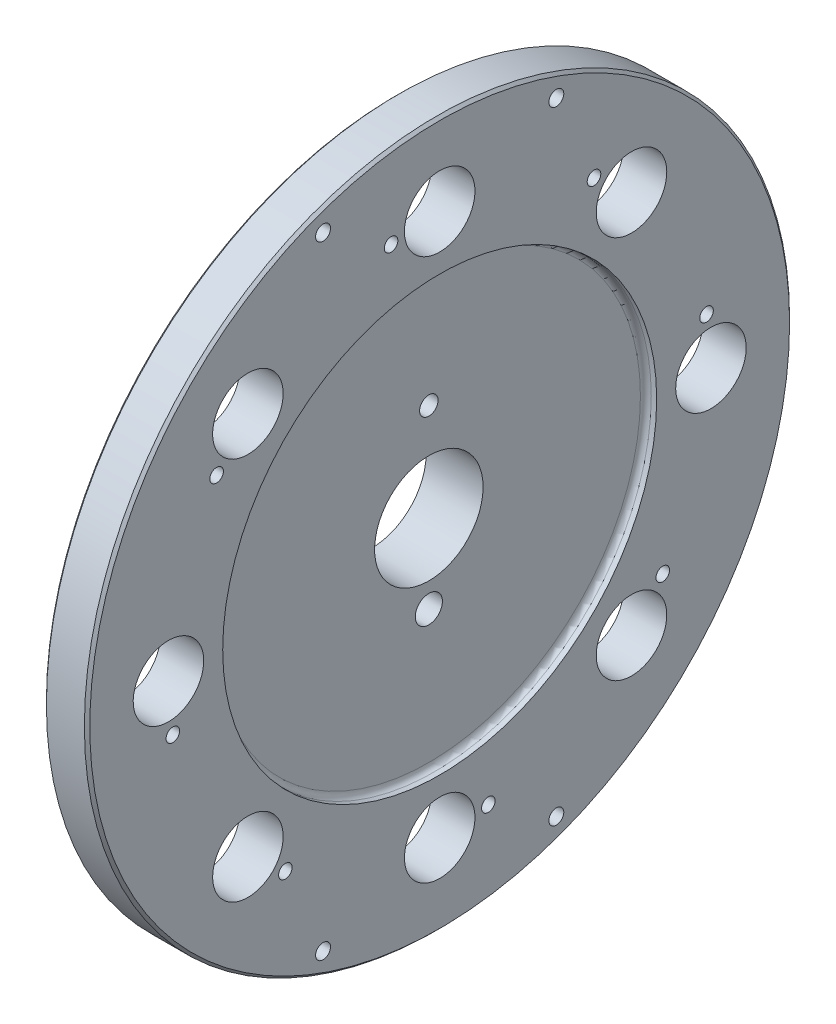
ISO-10303-21;
HEADER;
FILE_DESCRIPTION(('STEP AP214'),'2;1');
FILE_NAME('part.step','',(''),(''),'','','');
FILE_SCHEMA(('AUTOMOTIVE_DESIGN { 1 0 10303 214 1 1 1 1 }'));
ENDSEC;
DATA;
#1=APPLICATION_CONTEXT('core data for automotive mechanical design processes');
#2=APPLICATION_PROTOCOL_DEFINITION('international standard','automotive_design',2000,#1);
#3=PRODUCT_CONTEXT('',#1,'mechanical');
#4=PRODUCT('Part','Part','',(#3));
#5=PRODUCT_RELATED_PRODUCT_CATEGORY('part','',(#4));
#6=PRODUCT_DEFINITION_FORMATION('','',#4);
#7=PRODUCT_DEFINITION_CONTEXT('part definition',#1,'design');
#8=PRODUCT_DEFINITION('design','',#6,#7);
#9=PRODUCT_DEFINITION_SHAPE('','',#8);
#10=(LENGTH_UNIT() NAMED_UNIT(*) SI_UNIT(.MILLI.,.METRE.));
#11=(NAMED_UNIT(*) PLANE_ANGLE_UNIT() SI_UNIT($,.RADIAN.));
#12=(NAMED_UNIT(*) SI_UNIT($,.STERADIAN.) SOLID_ANGLE_UNIT());
#13=UNCERTAINTY_MEASURE_WITH_UNIT(LENGTH_MEASURE(1.E-05),#10,'distance_accuracy_value','');
#14=(GEOMETRIC_REPRESENTATION_CONTEXT(3) GLOBAL_UNCERTAINTY_ASSIGNED_CONTEXT((#13)) GLOBAL_UNIT_ASSIGNED_CONTEXT((#10,
#11,#12)) REPRESENTATION_CONTEXT('',''));
#15=CARTESIAN_POINT('',(0.,0.,0.));
#16=DIRECTION('',(0.,0.,1.));
#17=DIRECTION('',(1.,0.,0.));
#18=AXIS2_PLACEMENT_3D('',#15,#16,#17);
#19=CARTESIAN_POINT('',(14.9768902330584,80.,0.));
#20=DIRECTION('',(1.,0.,0.));
#21=DIRECTION('',(0.,0.,-1.));
#22=AXIS2_PLACEMENT_3D('',#19,#20,#21);
#23=PLANE('',#22);
#24=CARTESIAN_POINT('',(14.9768902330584,114.705056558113,-43.));
#25=DIRECTION('',(-1.,0.,0.));
#26=DIRECTION('',(0.,0.,1.));
#27=AXIS2_PLACEMENT_3D('',#24,#25,#26);
#28=CIRCLE('',#27,2.75);
#29=CARTESIAN_POINT('',(14.9768902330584,114.705056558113,-40.25));
#30=VERTEX_POINT('',#29);
#31=EDGE_CURVE('E412',#30,#30,#28,.T.);
#32=ORIENTED_EDGE('',*,*,#31,.T.);
#33=EDGE_LOOP('',(#32));
#34=FACE_BOUND('',#33,.T.);
#35=CARTESIAN_POINT('',(14.9768902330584,114.705056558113,43.));
#36=DIRECTION('',(-1.,0.,0.));
#37=DIRECTION('',(0.,0.,1.));
#38=AXIS2_PLACEMENT_3D('',#35,#36,#37);
#39=CIRCLE('',#38,2.75);
#40=CARTESIAN_POINT('',(14.9768902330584,114.705056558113,45.75));
#41=VERTEX_POINT('',#40);
#42=EDGE_CURVE('E423',#41,#41,#39,.T.);
#43=ORIENTED_EDGE('',*,*,#42,.T.);
#44=EDGE_LOOP('',(#43));
#45=FACE_BOUND('',#44,.T.);
#46=CARTESIAN_POINT('',(14.9768902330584,-114.705056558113,-43.));
#47=DIRECTION('',(-1.,0.,0.));
#48=DIRECTION('',(0.,0.,1.));
#49=AXIS2_PLACEMENT_3D('',#46,#47,#48);
#50=CIRCLE('',#49,2.75);
#51=CARTESIAN_POINT('',(14.9768902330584,-114.705056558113,-40.25));
#52=VERTEX_POINT('',#51);
#53=EDGE_CURVE('E435',#52,#52,#50,.T.);
#54=ORIENTED_EDGE('',*,*,#53,.T.);
#55=EDGE_LOOP('',(#54));
#56=FACE_BOUND('',#55,.T.);
#57=CARTESIAN_POINT('',(14.9768902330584,-114.705056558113,43.));
#58=DIRECTION('',(-1.,0.,0.));
#59=DIRECTION('',(0.,0.,1.));
#60=AXIS2_PLACEMENT_3D('',#57,#58,#59);
#61=CIRCLE('',#60,2.75);
#62=CARTESIAN_POINT('',(14.9768902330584,-114.705056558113,45.75));
#63=VERTEX_POINT('',#62);
#64=EDGE_CURVE('E446',#63,#63,#61,.T.);
#65=ORIENTED_EDGE('',*,*,#64,.T.);
#66=EDGE_LOOP('',(#65));
#67=FACE_BOUND('',#66,.T.);
#68=CARTESIAN_POINT('',(14.9768902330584,-82.2414343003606,56.8888959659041));
#69=DIRECTION('',(1.,0.,0.));
#70=DIRECTION('',(0.,0.,-1.));
#71=AXIS2_PLACEMENT_3D('',#68,#69,#70);
#72=CIRCLE('',#71,2.49999999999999);
#73=CARTESIAN_POINT('',(14.9768902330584,-82.2414343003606,54.3888959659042));
#74=VERTEX_POINT('',#73);
#75=EDGE_CURVE('E119',#74,#74,#72,.T.);
#76=ORIENTED_EDGE('',*,*,#75,.F.);
#77=EDGE_LOOP('',(#76));
#78=FACE_BOUND('',#77,.T.);
#79=CARTESIAN_POINT('',(14.9768902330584,-17.9269517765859,98.3799999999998));
#80=DIRECTION('',(1.,0.,0.));
#81=DIRECTION('',(0.,0.,-1.));
#82=AXIS2_PLACEMENT_3D('',#79,#80,#81);
#83=CIRCLE('',#82,2.49999999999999);
#84=CARTESIAN_POINT('',(14.9768902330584,-17.9269517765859,95.8799999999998));
#85=VERTEX_POINT('',#84);
#86=EDGE_CURVE('E109',#85,#85,#83,.T.);
#87=ORIENTED_EDGE('',*,*,#86,.F.);
#88=EDGE_LOOP('',(#87));
#89=FACE_BOUND('',#88,.T.);
#90=CARTESIAN_POINT('',(14.9768902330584,56.8888959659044,82.2414343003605));
#91=DIRECTION('',(1.,0.,0.));
#92=DIRECTION('',(0.,0.,-1.));
#93=AXIS2_PLACEMENT_3D('',#90,#91,#92);
#94=CIRCLE('',#93,2.49999999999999);
#95=CARTESIAN_POINT('',(14.9768902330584,56.8888959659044,79.7414343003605));
#96=VERTEX_POINT('',#95);
#97=EDGE_CURVE('E106',#96,#96,#94,.T.);
#98=ORIENTED_EDGE('',*,*,#97,.F.);
#99=EDGE_LOOP('',(#98));
#100=FACE_BOUND('',#99,.T.);
#101=CARTESIAN_POINT('',(14.9768902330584,98.38,17.9269517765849));
#102=DIRECTION('',(1.,0.,0.));
#103=DIRECTION('',(0.,0.,-1.));
#104=AXIS2_PLACEMENT_3D('',#101,#102,#103);
#105=CIRCLE('',#104,2.49999999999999);
#106=CARTESIAN_POINT('',(14.9768902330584,98.38,15.4269517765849));
#107=VERTEX_POINT('',#106);
#108=EDGE_CURVE('E103',#107,#107,#105,.T.);
#109=ORIENTED_EDGE('',*,*,#108,.F.);
#110=EDGE_LOOP('',(#109));
#111=FACE_BOUND('',#110,.T.);
#112=CARTESIAN_POINT('',(14.9768902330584,82.2414343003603,-56.8888959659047));
#113=DIRECTION('',(1.,0.,0.));
#114=DIRECTION('',(0.,0.,-1.));
#115=AXIS2_PLACEMENT_3D('',#112,#113,#114);
#116=CIRCLE('',#115,2.49999999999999);
#117=CARTESIAN_POINT('',(14.9768902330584,82.2414343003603,-59.3888959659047));
#118=VERTEX_POINT('',#117);
#119=EDGE_CURVE('E99',#118,#118,#116,.T.);
#120=ORIENTED_EDGE('',*,*,#119,.F.);
#121=EDGE_LOOP('',(#120));
#122=FACE_BOUND('',#121,.T.);
#123=CARTESIAN_POINT('',(14.9768902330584,17.9269517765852,-98.3799999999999));
#124=DIRECTION('',(1.,0.,0.));
#125=DIRECTION('',(0.,0.,-1.));
#126=AXIS2_PLACEMENT_3D('',#123,#124,#125);
#127=CIRCLE('',#126,2.49999999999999);
#128=CARTESIAN_POINT('',(14.9768902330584,17.9269517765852,-100.88));
#129=VERTEX_POINT('',#128);
#130=EDGE_CURVE('E95',#129,#129,#127,.T.);
#131=ORIENTED_EDGE('',*,*,#130,.F.);
#132=EDGE_LOOP('',(#131));
#133=FACE_BOUND('',#132,.T.);
#134=CARTESIAN_POINT('',(14.9768902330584,-56.888895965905,-82.2414343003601));
#135=DIRECTION('',(1.,0.,0.));
#136=DIRECTION('',(0.,0.,-1.));
#137=AXIS2_PLACEMENT_3D('',#134,#135,#136);
#138=CIRCLE('',#137,2.49999999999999);
#139=CARTESIAN_POINT('',(14.9768902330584,-56.888895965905,-84.74143430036));
#140=VERTEX_POINT('',#139);
#141=EDGE_CURVE('E91',#140,#140,#138,.T.);
#142=ORIENTED_EDGE('',*,*,#141,.F.);
#143=EDGE_LOOP('',(#142));
#144=FACE_BOUND('',#143,.T.);
#145=CARTESIAN_POINT('',(14.9768902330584,-98.38,-17.9269517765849));
#146=DIRECTION('',(1.,0.,0.));
#147=DIRECTION('',(0.,0.,-1.));
#148=AXIS2_PLACEMENT_3D('',#145,#146,#147);
#149=CIRCLE('',#148,2.49999999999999);
#150=CARTESIAN_POINT('',(14.9768902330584,-98.38,-20.4269517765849));
#151=VERTEX_POINT('',#150);
#152=EDGE_CURVE('E87',#151,#151,#149,.T.);
#153=ORIENTED_EDGE('',*,*,#152,.F.);
#154=EDGE_LOOP('',(#153));
#155=FACE_BOUND('',#154,.T.);
#156=CARTESIAN_POINT('',(14.9768902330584,-70.7106781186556,70.7106781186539));
#157=DIRECTION('',(1.,0.,0.));
#158=DIRECTION('',(0.,-0.707106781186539,-0.707106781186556));
#159=AXIS2_PLACEMENT_3D('',#156,#157,#158);
#160=CIRCLE('',#159,13.);
#161=CARTESIAN_POINT('',(14.9768902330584,-79.9030662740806,61.5182899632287));
#162=VERTEX_POINT('',#161);
#163=EDGE_CURVE('E83',#162,#162,#160,.T.);
#164=ORIENTED_EDGE('',*,*,#163,.F.);
#165=EDGE_LOOP('',(#164));
#166=FACE_BOUND('',#165,.T.);
#167=CARTESIAN_POINT('',(14.9768902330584,-1.04777297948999E-12,100.));
#168=DIRECTION('',(1.,0.,0.));
#169=DIRECTION('',(0.,-1.,0.));
#170=AXIS2_PLACEMENT_3D('',#167,#168,#169);
#171=CIRCLE('',#170,13.);
#172=CARTESIAN_POINT('',(14.9768902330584,-13.000000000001,99.9999999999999));
#173=VERTEX_POINT('',#172);
#174=EDGE_CURVE('E79',#173,#173,#171,.T.);
#175=ORIENTED_EDGE('',*,*,#174,.F.);
#176=EDGE_LOOP('',(#175));
#177=FACE_BOUND('',#176,.T.);
#178=CARTESIAN_POINT('',(14.9768902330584,70.7106781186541,70.7106781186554));
#179=DIRECTION('',(1.,0.,0.));
#180=DIRECTION('',(0.,-0.707106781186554,0.707106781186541));
#181=AXIS2_PLACEMENT_3D('',#178,#179,#180);
#182=CIRCLE('',#181,13.);
#183=CARTESIAN_POINT('',(14.9768902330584,61.5182899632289,79.9030662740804));
#184=VERTEX_POINT('',#183);
#185=EDGE_CURVE('E75',#184,#184,#182,.T.);
#186=ORIENTED_EDGE('',*,*,#185,.F.);
#187=EDGE_LOOP('',(#186));
#188=FACE_BOUND('',#187,.T.);
#189=CARTESIAN_POINT('',(14.9768902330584,100.,0.));
#190=DIRECTION('',(1.,0.,0.));
#191=DIRECTION('',(0.,0.,1.));
#192=AXIS2_PLACEMENT_3D('',#189,#190,#191);
#193=CIRCLE('',#192,13.);
#194=CARTESIAN_POINT('',(14.9768902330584,100.,13.));
#195=VERTEX_POINT('',#194);
#196=EDGE_CURVE('E71',#195,#195,#193,.T.);
#197=ORIENTED_EDGE('',*,*,#196,.F.);
#198=EDGE_LOOP('',(#197));
#199=FACE_BOUND('',#198,.T.);
#200=CARTESIAN_POINT('',(14.9768902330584,70.7106781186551,-70.7106781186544));
#201=DIRECTION('',(1.,0.,0.));
#202=DIRECTION('',(0.,0.707106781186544,0.707106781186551));
#203=AXIS2_PLACEMENT_3D('',#200,#201,#202);
#204=CIRCLE('',#203,13.);
#205=CARTESIAN_POINT('',(14.9768902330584,79.9030662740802,-61.5182899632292));
#206=VERTEX_POINT('',#205);
#207=EDGE_CURVE('E67',#206,#206,#204,.T.);
#208=ORIENTED_EDGE('',*,*,#207,.F.);
#209=EDGE_LOOP('',(#208));
#210=FACE_BOUND('',#209,.T.);
#211=CARTESIAN_POINT('',(14.9768902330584,3.48679418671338E-13,-100.));
#212=DIRECTION('',(1.,0.,0.));
#213=DIRECTION('',(0.,1.,0.));
#214=AXIS2_PLACEMENT_3D('',#211,#212,#213);
#215=CIRCLE('',#214,13.);
#216=CARTESIAN_POINT('',(14.9768902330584,13.0000000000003,-100.));
#217=VERTEX_POINT('',#216);
#218=EDGE_CURVE('E63',#217,#217,#215,.T.);
#219=ORIENTED_EDGE('',*,*,#218,.F.);
#220=EDGE_LOOP('',(#219));
#221=FACE_BOUND('',#220,.T.);
#222=CARTESIAN_POINT('',(14.9768902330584,-70.7106781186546,-70.7106781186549));
#223=DIRECTION('',(1.,0.,0.));
#224=DIRECTION('',(0.,0.707106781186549,-0.707106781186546));
#225=AXIS2_PLACEMENT_3D('',#222,#223,#224);
#226=CIRCLE('',#225,13.);
#227=CARTESIAN_POINT('',(14.9768902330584,-61.5182899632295,-79.90306627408));
#228=VERTEX_POINT('',#227);
#229=EDGE_CURVE('E59',#228,#228,#226,.T.);
#230=ORIENTED_EDGE('',*,*,#229,.F.);
#231=EDGE_LOOP('',(#230));
#232=FACE_BOUND('',#231,.T.);
#233=CARTESIAN_POINT('',(14.9768902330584,-100.,0.));
#234=DIRECTION('',(1.,0.,0.));
#235=DIRECTION('',(0.,0.,-1.));
#236=AXIS2_PLACEMENT_3D('',#233,#234,#235);
#237=CIRCLE('',#236,13.);
#238=CARTESIAN_POINT('',(14.9768902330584,-100.,-13.));
#239=VERTEX_POINT('',#238);
#240=EDGE_CURVE('E55',#239,#239,#237,.T.);
#241=ORIENTED_EDGE('',*,*,#240,.F.);
#242=EDGE_LOOP('',(#241));
#243=FACE_BOUND('',#242,.T.);
#244=CARTESIAN_POINT('',(14.9768902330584,0.,0.));
#245=DIRECTION('',(1.,0.,0.));
#246=DIRECTION('',(0.,0.,-1.));
#247=AXIS2_PLACEMENT_3D('',#244,#245,#246);
#248=CIRCLE('',#247,129.);
#249=CARTESIAN_POINT('',(14.9768902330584,0.,-129.));
#250=VERTEX_POINT('',#249);
#251=EDGE_CURVE('E181',#250,#250,#248,.T.);
#252=ORIENTED_EDGE('',*,*,#251,.T.);
#253=EDGE_LOOP('',(#252));
#254=FACE_BOUND('',#253,.T.);
#255=CARTESIAN_POINT('',(14.9768902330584,0.,0.));
#256=DIRECTION('',(1.,0.,0.));
#257=DIRECTION('',(0.,0.,-1.));
#258=AXIS2_PLACEMENT_3D('',#255,#256,#257);
#259=CIRCLE('',#258,80.);
#260=CARTESIAN_POINT('',(14.9768902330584,0.,-80.));
#261=VERTEX_POINT('',#260);
#262=EDGE_CURVE('E157',#261,#261,#259,.T.);
#263=ORIENTED_EDGE('',*,*,#262,.F.);
#264=EDGE_LOOP('',(#263));
#265=FACE_BOUND('',#264,.T.);
#266=ADVANCED_FACE('F34',(#34,#45,#56,#67,#78,#89,#100,#111,#122,#133,#144,#155,#166,#177,#188,
#199,#210,#221,#232,#243,#254,#265),#23,.T.);
#267=CARTESIAN_POINT('',(0.,0.,0.));
#268=DIRECTION('',(1.,0.,0.));
#269=DIRECTION('',(0.,0.,-1.));
#270=AXIS2_PLACEMENT_3D('',#267,#268,#269);
#271=CYLINDRICAL_SURFACE('',#270,130.);
#272=CARTESIAN_POINT('',(-0.0231097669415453,0.,0.));
#273=DIRECTION('',(-1.,0.,0.));
#274=DIRECTION('',(0.,0.,1.));
#275=AXIS2_PLACEMENT_3D('',#272,#273,#274);
#276=CIRCLE('',#275,130.);
#277=CARTESIAN_POINT('',(-0.0231097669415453,0.,130.));
#278=VERTEX_POINT('',#277);
#279=EDGE_CURVE('E175',#278,#278,#276,.F.);
#280=ORIENTED_EDGE('',*,*,#279,.T.);
#281=EDGE_LOOP('',(#280));
#282=FACE_BOUND('',#281,.T.);
#283=CARTESIAN_POINT('',(13.9768902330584,0.,0.));
#284=DIRECTION('',(1.,0.,0.));
#285=DIRECTION('',(0.,0.,-1.));
#286=AXIS2_PLACEMENT_3D('',#283,#284,#285);
#287=CIRCLE('',#286,130.);
#288=CARTESIAN_POINT('',(13.9768902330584,0.,-130.));
#289=VERTEX_POINT('',#288);
#290=EDGE_CURVE('E172',#289,#289,#287,.F.);
#291=ORIENTED_EDGE('',*,*,#290,.T.);
#292=EDGE_LOOP('',(#291));
#293=FACE_BOUND('',#292,.T.);
#294=ADVANCED_FACE('F231',(#282,#293),#271,.T.);
#295=CARTESIAN_POINT('',(-1.02310976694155,130.,0.));
#296=DIRECTION('',(-1.,0.,0.));
#297=DIRECTION('',(0.,0.,1.));
#298=AXIS2_PLACEMENT_3D('',#295,#296,#297);
#299=PLANE('',#298);
#300=CARTESIAN_POINT('',(-1.02310976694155,114.705056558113,-43.));
#301=DIRECTION('',(-1.,0.,0.));
#302=DIRECTION('',(0.,0.,1.));
#303=AXIS2_PLACEMENT_3D('',#300,#301,#302);
#304=CIRCLE('',#303,5.20000000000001);
#305=CARTESIAN_POINT('',(-1.02310976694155,114.705056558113,-37.8));
#306=VERTEX_POINT('',#305);
#307=EDGE_CURVE('E405',#306,#306,#304,.T.);
#308=ORIENTED_EDGE('',*,*,#307,.F.);
#309=EDGE_LOOP('',(#308));
#310=FACE_BOUND('',#309,.T.);
#311=CARTESIAN_POINT('',(-1.02310976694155,114.705056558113,43.));
#312=DIRECTION('',(-1.,0.,0.));
#313=DIRECTION('',(0.,0.,1.));
#314=AXIS2_PLACEMENT_3D('',#311,#312,#313);
#315=CIRCLE('',#314,5.20000000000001);
#316=CARTESIAN_POINT('',(-1.02310976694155,114.705056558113,48.2));
#317=VERTEX_POINT('',#316);
#318=EDGE_CURVE('E414',#317,#317,#315,.T.);
#319=ORIENTED_EDGE('',*,*,#318,.F.);
#320=EDGE_LOOP('',(#319));
#321=FACE_BOUND('',#320,.T.);
#322=CARTESIAN_POINT('',(-1.02310976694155,-114.705056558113,-43.));
#323=DIRECTION('',(-1.,0.,0.));
#324=DIRECTION('',(0.,0.,1.));
#325=AXIS2_PLACEMENT_3D('',#322,#323,#324);
#326=CIRCLE('',#325,5.20000000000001);
#327=CARTESIAN_POINT('',(-1.02310976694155,-114.705056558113,-37.8));
#328=VERTEX_POINT('',#327);
#329=EDGE_CURVE('E426',#328,#328,#326,.T.);
#330=ORIENTED_EDGE('',*,*,#329,.F.);
#331=EDGE_LOOP('',(#330));
#332=FACE_BOUND('',#331,.T.);
#333=CARTESIAN_POINT('',(-1.02310976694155,-114.705056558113,43.));
#334=DIRECTION('',(-1.,0.,0.));
#335=DIRECTION('',(0.,0.,1.));
#336=AXIS2_PLACEMENT_3D('',#333,#334,#335);
#337=CIRCLE('',#336,5.20000000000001);
#338=CARTESIAN_POINT('',(-1.02310976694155,-114.705056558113,48.2));
#339=VERTEX_POINT('',#338);
#340=EDGE_CURVE('E438',#339,#339,#337,.T.);
#341=ORIENTED_EDGE('',*,*,#340,.F.);
#342=EDGE_LOOP('',(#341));
#343=FACE_BOUND('',#342,.T.);
#344=CARTESIAN_POINT('',(-1.02310976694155,-82.2414343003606,56.8888959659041));
#345=DIRECTION('',(-1.,0.,0.));
#346=DIRECTION('',(0.,0.,1.));
#347=AXIS2_PLACEMENT_3D('',#344,#345,#346);
#348=CIRCLE('',#347,2.49999999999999);
#349=CARTESIAN_POINT('',(-1.02310976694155,-82.2414343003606,59.3888959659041));
#350=VERTEX_POINT('',#349);
#351=EDGE_CURVE('E38',#350,#350,#348,.T.);
#352=ORIENTED_EDGE('',*,*,#351,.F.);
#353=EDGE_LOOP('',(#352));
#354=FACE_BOUND('',#353,.T.);
#355=CARTESIAN_POINT('',(-1.02310976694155,-17.9269517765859,98.3799999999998));
#356=DIRECTION('',(-1.,0.,0.));
#357=DIRECTION('',(0.,0.,1.));
#358=AXIS2_PLACEMENT_3D('',#355,#356,#357);
#359=CIRCLE('',#358,2.49999999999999);
#360=CARTESIAN_POINT('',(-1.02310976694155,-17.9269517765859,100.88));
#361=VERTEX_POINT('',#360);
#362=EDGE_CURVE('E107',#361,#361,#359,.T.);
#363=ORIENTED_EDGE('',*,*,#362,.F.);
#364=EDGE_LOOP('',(#363));
#365=FACE_BOUND('',#364,.T.);
#366=CARTESIAN_POINT('',(-1.02310976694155,56.8888959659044,82.2414343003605));
#367=DIRECTION('',(-1.,0.,0.));
#368=DIRECTION('',(0.,0.,1.));
#369=AXIS2_PLACEMENT_3D('',#366,#367,#368);
#370=CIRCLE('',#369,2.49999999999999);
#371=CARTESIAN_POINT('',(-1.02310976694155,56.8888959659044,84.7414343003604));
#372=VERTEX_POINT('',#371);
#373=EDGE_CURVE('E104',#372,#372,#370,.T.);
#374=ORIENTED_EDGE('',*,*,#373,.F.);
#375=EDGE_LOOP('',(#374));
#376=FACE_BOUND('',#375,.T.);
#377=CARTESIAN_POINT('',(-1.02310976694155,98.38,17.9269517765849));
#378=DIRECTION('',(-1.,0.,0.));
#379=DIRECTION('',(0.,0.,1.));
#380=AXIS2_PLACEMENT_3D('',#377,#378,#379);
#381=CIRCLE('',#380,2.49999999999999);
#382=CARTESIAN_POINT('',(-1.02310976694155,98.38,20.4269517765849));
#383=VERTEX_POINT('',#382);
#384=EDGE_CURVE('E100',#383,#383,#381,.T.);
#385=ORIENTED_EDGE('',*,*,#384,.F.);
#386=EDGE_LOOP('',(#385));
#387=FACE_BOUND('',#386,.T.);
#388=CARTESIAN_POINT('',(-1.02310976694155,82.2414343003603,-56.8888959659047));
#389=DIRECTION('',(-1.,0.,0.));
#390=DIRECTION('',(0.,0.,1.));
#391=AXIS2_PLACEMENT_3D('',#388,#389,#390);
#392=CIRCLE('',#391,2.49999999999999);
#393=CARTESIAN_POINT('',(-1.02310976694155,82.2414343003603,-54.3888959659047));
#394=VERTEX_POINT('',#393);
#395=EDGE_CURVE('E96',#394,#394,#392,.T.);
#396=ORIENTED_EDGE('',*,*,#395,.F.);
#397=EDGE_LOOP('',(#396));
#398=FACE_BOUND('',#397,.T.);
#399=CARTESIAN_POINT('',(-1.02310976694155,17.9269517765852,-98.3799999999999));
#400=DIRECTION('',(-1.,0.,0.));
#401=DIRECTION('',(0.,0.,1.));
#402=AXIS2_PLACEMENT_3D('',#399,#400,#401);
#403=CIRCLE('',#402,2.49999999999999);
#404=CARTESIAN_POINT('',(-1.02310976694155,17.9269517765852,-95.88));
#405=VERTEX_POINT('',#404);
#406=EDGE_CURVE('E92',#405,#405,#403,.T.);
#407=ORIENTED_EDGE('',*,*,#406,.F.);
#408=EDGE_LOOP('',(#407));
#409=FACE_BOUND('',#408,.T.);
#410=CARTESIAN_POINT('',(-1.02310976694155,-56.888895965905,-82.2414343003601));
#411=DIRECTION('',(-1.,0.,0.));
#412=DIRECTION('',(0.,0.,1.));
#413=AXIS2_PLACEMENT_3D('',#410,#411,#412);
#414=CIRCLE('',#413,2.49999999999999);
#415=CARTESIAN_POINT('',(-1.02310976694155,-56.888895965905,-79.7414343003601));
#416=VERTEX_POINT('',#415);
#417=EDGE_CURVE('E88',#416,#416,#414,.T.);
#418=ORIENTED_EDGE('',*,*,#417,.F.);
#419=EDGE_LOOP('',(#418));
#420=FACE_BOUND('',#419,.T.);
#421=CARTESIAN_POINT('',(-1.02310976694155,-98.38,-17.9269517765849));
#422=DIRECTION('',(-1.,0.,0.));
#423=DIRECTION('',(0.,0.,1.));
#424=AXIS2_PLACEMENT_3D('',#421,#422,#423);
#425=CIRCLE('',#424,2.49999999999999);
#426=CARTESIAN_POINT('',(-1.02310976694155,-98.38,-15.4269517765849));
#427=VERTEX_POINT('',#426);
#428=EDGE_CURVE('E84',#427,#427,#425,.T.);
#429=ORIENTED_EDGE('',*,*,#428,.F.);
#430=EDGE_LOOP('',(#429));
#431=FACE_BOUND('',#430,.T.);
#432=CARTESIAN_POINT('',(-1.02310976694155,-70.7106781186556,70.7106781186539));
#433=DIRECTION('',(-1.,0.,0.));
#434=DIRECTION('',(0.,0.,1.));
#435=AXIS2_PLACEMENT_3D('',#432,#433,#434);
#436=CIRCLE('',#435,13.);
#437=CARTESIAN_POINT('',(-1.02310976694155,-70.7106781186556,83.7106781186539));
#438=VERTEX_POINT('',#437);
#439=EDGE_CURVE('E80',#438,#438,#436,.T.);
#440=ORIENTED_EDGE('',*,*,#439,.F.);
#441=EDGE_LOOP('',(#440));
#442=FACE_BOUND('',#441,.T.);
#443=CARTESIAN_POINT('',(-1.02310976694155,-1.04777297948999E-12,100.));
#444=DIRECTION('',(-1.,0.,0.));
#445=DIRECTION('',(0.,0.,1.));
#446=AXIS2_PLACEMENT_3D('',#443,#444,#445);
#447=CIRCLE('',#446,13.);
#448=CARTESIAN_POINT('',(-1.02310976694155,-1.04777297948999E-12,113.));
#449=VERTEX_POINT('',#448);
#450=EDGE_CURVE('E76',#449,#449,#447,.T.);
#451=ORIENTED_EDGE('',*,*,#450,.F.);
#452=EDGE_LOOP('',(#451));
#453=FACE_BOUND('',#452,.T.);
#454=CARTESIAN_POINT('',(-1.02310976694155,70.7106781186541,70.7106781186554));
#455=DIRECTION('',(-1.,0.,0.));
#456=DIRECTION('',(0.,0.,1.));
#457=AXIS2_PLACEMENT_3D('',#454,#455,#456);
#458=CIRCLE('',#457,13.);
#459=CARTESIAN_POINT('',(-1.02310976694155,70.7106781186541,83.7106781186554));
#460=VERTEX_POINT('',#459);
#461=EDGE_CURVE('E72',#460,#460,#458,.T.);
#462=ORIENTED_EDGE('',*,*,#461,.F.);
#463=EDGE_LOOP('',(#462));
#464=FACE_BOUND('',#463,.T.);
#465=CARTESIAN_POINT('',(-1.02310976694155,100.,0.));
#466=DIRECTION('',(-1.,0.,0.));
#467=DIRECTION('',(0.,0.,1.));
#468=AXIS2_PLACEMENT_3D('',#465,#466,#467);
#469=CIRCLE('',#468,13.);
#470=CARTESIAN_POINT('',(-1.02310976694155,100.,13.));
#471=VERTEX_POINT('',#470);
#472=EDGE_CURVE('E68',#471,#471,#469,.T.);
#473=ORIENTED_EDGE('',*,*,#472,.F.);
#474=EDGE_LOOP('',(#473));
#475=FACE_BOUND('',#474,.T.);
#476=CARTESIAN_POINT('',(-1.02310976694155,70.7106781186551,-70.7106781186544));
#477=DIRECTION('',(-1.,0.,0.));
#478=DIRECTION('',(0.,0.,1.));
#479=AXIS2_PLACEMENT_3D('',#476,#477,#478);
#480=CIRCLE('',#479,13.);
#481=CARTESIAN_POINT('',(-1.02310976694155,70.7106781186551,-57.7106781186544));
#482=VERTEX_POINT('',#481);
#483=EDGE_CURVE('E64',#482,#482,#480,.T.);
#484=ORIENTED_EDGE('',*,*,#483,.F.);
#485=EDGE_LOOP('',(#484));
#486=FACE_BOUND('',#485,.T.);
#487=CARTESIAN_POINT('',(-1.02310976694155,3.48679418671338E-13,-100.));
#488=DIRECTION('',(-1.,0.,0.));
#489=DIRECTION('',(0.,0.,1.));
#490=AXIS2_PLACEMENT_3D('',#487,#488,#489);
#491=CIRCLE('',#490,13.);
#492=CARTESIAN_POINT('',(-1.02310976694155,3.48679418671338E-13,-87.));
#493=VERTEX_POINT('',#492);
#494=EDGE_CURVE('E60',#493,#493,#491,.T.);
#495=ORIENTED_EDGE('',*,*,#494,.F.);
#496=EDGE_LOOP('',(#495));
#497=FACE_BOUND('',#496,.T.);
#498=CARTESIAN_POINT('',(-1.02310976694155,-70.7106781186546,-70.7106781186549));
#499=DIRECTION('',(-1.,0.,0.));
#500=DIRECTION('',(0.,0.,1.));
#501=AXIS2_PLACEMENT_3D('',#498,#499,#500);
#502=CIRCLE('',#501,13.);
#503=CARTESIAN_POINT('',(-1.02310976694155,-70.7106781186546,-57.7106781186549));
#504=VERTEX_POINT('',#503);
#505=EDGE_CURVE('E56',#504,#504,#502,.T.);
#506=ORIENTED_EDGE('',*,*,#505,.F.);
#507=EDGE_LOOP('',(#506));
#508=FACE_BOUND('',#507,.T.);
#509=CARTESIAN_POINT('',(-1.02310976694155,-100.,0.));
#510=DIRECTION('',(-1.,0.,0.));
#511=DIRECTION('',(0.,0.,1.));
#512=AXIS2_PLACEMENT_3D('',#509,#510,#511);
#513=CIRCLE('',#512,13.);
#514=CARTESIAN_POINT('',(-1.02310976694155,-100.,13.));
#515=VERTEX_POINT('',#514);
#516=EDGE_CURVE('E51',#515,#515,#513,.T.);
#517=ORIENTED_EDGE('',*,*,#516,.F.);
#518=EDGE_LOOP('',(#517));
#519=FACE_BOUND('',#518,.T.);
#520=CARTESIAN_POINT('',(-1.02310976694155,0.,0.));
#521=DIRECTION('',(-1.,0.,0.));
#522=DIRECTION('',(0.,0.,1.));
#523=AXIS2_PLACEMENT_3D('',#520,#521,#522);
#524=CIRCLE('',#523,61.);
#525=CARTESIAN_POINT('',(-1.02310976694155,0.,61.));
#526=VERTEX_POINT('',#525);
#527=EDGE_CURVE('E184',#526,#526,#524,.F.);
#528=ORIENTED_EDGE('',*,*,#527,.T.);
#529=EDGE_LOOP('',(#528));
#530=FACE_BOUND('',#529,.T.);
#531=CARTESIAN_POINT('',(-1.02310976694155,0.,0.));
#532=DIRECTION('',(-1.,0.,0.));
#533=DIRECTION('',(0.,0.,1.));
#534=AXIS2_PLACEMENT_3D('',#531,#532,#533);
#535=CIRCLE('',#534,129.);
#536=CARTESIAN_POINT('',(-1.02310976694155,0.,129.));
#537=VERTEX_POINT('',#536);
#538=EDGE_CURVE('E178',#537,#537,#535,.T.);
#539=ORIENTED_EDGE('',*,*,#538,.T.);
#540=EDGE_LOOP('',(#539));
#541=FACE_BOUND('',#540,.T.);
#542=ADVANCED_FACE('F226',(#310,#321,#332,#343,#354,#365,#376,#387,#398,#409,#420,#431,#442,
#453,#464,#475,#486,#497,#508,#519,#530,#541),#299,.T.);
#543=CARTESIAN_POINT('',(0.,0.,0.));
#544=DIRECTION('',(1.,0.,0.));
#545=DIRECTION('',(0.,0.,-1.));
#546=AXIS2_PLACEMENT_3D('',#543,#544,#545);
#547=CYLINDRICAL_SURFACE('',#546,60.);
#548=CARTESIAN_POINT('',(-2.02310976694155,0.,0.));
#549=DIRECTION('',(-1.,0.,0.));
#550=DIRECTION('',(0.,0.,1.));
#551=AXIS2_PLACEMENT_3D('',#548,#549,#550);
#552=CIRCLE('',#551,60.);
#553=CARTESIAN_POINT('',(-2.02310976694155,0.,60.));
#554=VERTEX_POINT('',#553);
#555=EDGE_CURVE('E187',#554,#554,#552,.T.);
#556=ORIENTED_EDGE('',*,*,#555,.T.);
#557=EDGE_LOOP('',(#556));
#558=FACE_BOUND('',#557,.T.);
#559=CARTESIAN_POINT('',(-9.02310976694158,0.,0.));
#560=DIRECTION('',(-1.,0.,0.));
#561=DIRECTION('',(0.,0.,1.));
#562=AXIS2_PLACEMENT_3D('',#559,#560,#561);
#563=CIRCLE('',#562,60.);
#564=CARTESIAN_POINT('',(-9.02310976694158,0.,60.));
#565=VERTEX_POINT('',#564);
#566=EDGE_CURVE('E166',#565,#565,#563,.F.);
#567=ORIENTED_EDGE('',*,*,#566,.T.);
#568=EDGE_LOOP('',(#567));
#569=FACE_BOUND('',#568,.T.);
#570=ADVANCED_FACE('F220',(#558,#569),#547,.T.);
#571=CARTESIAN_POINT('',(-10.0231097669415,60.,0.));
#572=DIRECTION('',(-1.,0.,0.));
#573=DIRECTION('',(0.,0.,1.));
#574=AXIS2_PLACEMENT_3D('',#571,#572,#573);
#575=PLANE('',#574);
#576=CARTESIAN_POINT('',(-10.0231097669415,36.,0.));
#577=DIRECTION('',(1.,0.,0.));
#578=DIRECTION('',(0.,0.,-1.));
#579=AXIS2_PLACEMENT_3D('',#576,#577,#578);
#580=CIRCLE('',#579,3.39999999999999);
#581=CARTESIAN_POINT('',(-10.0231097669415,36.,-3.39999999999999));
#582=VERTEX_POINT('',#581);
#583=EDGE_CURVE('E151',#582,#582,#580,.T.);
#584=ORIENTED_EDGE('',*,*,#583,.T.);
#585=EDGE_LOOP('',(#584));
#586=FACE_BOUND('',#585,.T.);
#587=CARTESIAN_POINT('',(-10.0231097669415,-29.,0.));
#588=DIRECTION('',(-1.,0.,0.));
#589=DIRECTION('',(0.,0.,1.));
#590=AXIS2_PLACEMENT_3D('',#587,#588,#589);
#591=CIRCLE('',#590,6.00000000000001);
#592=CARTESIAN_POINT('',(-10.0231097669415,-29.,6.00000000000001));
#593=VERTEX_POINT('',#592);
#594=EDGE_CURVE('E42',#593,#593,#591,.F.);
#595=ORIENTED_EDGE('',*,*,#594,.T.);
#596=EDGE_LOOP('',(#595));
#597=FACE_BOUND('',#596,.T.);
#598=CARTESIAN_POINT('',(-10.0231097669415,0.,0.));
#599=DIRECTION('',(-1.,0.,0.));
#600=DIRECTION('',(0.,0.,1.));
#601=AXIS2_PLACEMENT_3D('',#598,#599,#600);
#602=CIRCLE('',#601,59.);
#603=CARTESIAN_POINT('',(-10.0231097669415,0.,59.));
#604=VERTEX_POINT('',#603);
#605=EDGE_CURVE('E169',#604,#604,#602,.T.);
#606=ORIENTED_EDGE('',*,*,#605,.T.);
#607=EDGE_LOOP('',(#606));
#608=FACE_BOUND('',#607,.T.);
#609=CARTESIAN_POINT('',(-10.0231097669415,0.,0.));
#610=DIRECTION('',(1.,0.,0.));
#611=DIRECTION('',(0.,0.,-1.));
#612=AXIS2_PLACEMENT_3D('',#609,#610,#611);
#613=CIRCLE('',#612,20.);
#614=CARTESIAN_POINT('',(-10.0231097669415,0.,-20.));
#615=VERTEX_POINT('',#614);
#616=EDGE_CURVE('E163',#615,#615,#613,.T.);
#617=ORIENTED_EDGE('',*,*,#616,.T.);
#618=EDGE_LOOP('',(#617));
#619=FACE_BOUND('',#618,.T.);
#620=ADVANCED_FACE('F215',(#586,#597,#608,#619),#575,.T.);
#621=CARTESIAN_POINT('',(0.,0.,0.));
#622=DIRECTION('',(1.,0.,0.));
#623=DIRECTION('',(0.,0.,-1.));
#624=AXIS2_PLACEMENT_3D('',#621,#622,#623);
#625=CYLINDRICAL_SURFACE('',#624,20.);
#626=CARTESIAN_POINT('',(10.9768902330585,0.,0.));
#627=DIRECTION('',(1.,0.,0.));
#628=DIRECTION('',(0.,0.,-1.));
#629=AXIS2_PLACEMENT_3D('',#626,#627,#628);
#630=CIRCLE('',#629,20.);
#631=CARTESIAN_POINT('',(10.9768902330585,0.,-20.));
#632=VERTEX_POINT('',#631);
#633=EDGE_CURVE('E160',#632,#632,#630,.T.);
#634=ORIENTED_EDGE('',*,*,#633,.T.);
#635=EDGE_LOOP('',(#634));
#636=FACE_BOUND('',#635,.T.);
#637=ORIENTED_EDGE('',*,*,#616,.F.);
#638=EDGE_LOOP('',(#637));
#639=FACE_BOUND('',#638,.T.);
#640=ADVANCED_FACE('F208',(#636,#639),#625,.F.);
#641=CARTESIAN_POINT('',(10.9768902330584,80.,0.));
#642=DIRECTION('',(1.,0.,0.));
#643=DIRECTION('',(0.,0.,-1.));
#644=AXIS2_PLACEMENT_3D('',#641,#642,#643);
#645=PLANE('',#644);
#646=CARTESIAN_POINT('',(10.9768902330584,36.,0.));
#647=DIRECTION('',(1.,0.,0.));
#648=DIRECTION('',(0.,0.,-1.));
#649=AXIS2_PLACEMENT_3D('',#646,#647,#648);
#650=CIRCLE('',#649,3.39999999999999);
#651=CARTESIAN_POINT('',(10.9768902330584,36.,-3.39999999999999));
#652=VERTEX_POINT('',#651);
#653=EDGE_CURVE('E54',#652,#652,#650,.T.);
#654=ORIENTED_EDGE('',*,*,#653,.F.);
#655=EDGE_LOOP('',(#654));
#656=FACE_BOUND('',#655,.T.);
#657=CARTESIAN_POINT('',(10.9768902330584,-29.,0.));
#658=DIRECTION('',(1.,0.,0.));
#659=DIRECTION('',(0.,0.,-1.));
#660=AXIS2_PLACEMENT_3D('',#657,#658,#659);
#661=CIRCLE('',#660,5.);
#662=CARTESIAN_POINT('',(10.9768902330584,-29.,-5.));
#663=VERTEX_POINT('',#662);
#664=EDGE_CURVE('E154',#663,#663,#661,.T.);
#665=ORIENTED_EDGE('',*,*,#664,.F.);
#666=EDGE_LOOP('',(#665));
#667=FACE_BOUND('',#666,.T.);
#668=CARTESIAN_POINT('',(10.9768902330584,0.,0.));
#669=DIRECTION('',(1.,0.,0.));
#670=DIRECTION('',(0.,0.,-1.));
#671=AXIS2_PLACEMENT_3D('',#668,#669,#670);
#672=CIRCLE('',#671,78.);
#673=CARTESIAN_POINT('',(10.9768902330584,0.,-78.));
#674=VERTEX_POINT('',#673);
#675=EDGE_CURVE('E190',#674,#674,#672,.T.);
#676=ORIENTED_EDGE('',*,*,#675,.T.);
#677=EDGE_LOOP('',(#676));
#678=FACE_BOUND('',#677,.T.);
#679=ORIENTED_EDGE('',*,*,#633,.F.);
#680=EDGE_LOOP('',(#679));
#681=FACE_BOUND('',#680,.T.);
#682=ADVANCED_FACE('F205',(#656,#667,#678,#681),#645,.T.);
#683=CARTESIAN_POINT('',(0.,0.,0.));
#684=DIRECTION('',(1.,0.,0.));
#685=DIRECTION('',(0.,0.,-1.));
#686=AXIS2_PLACEMENT_3D('',#683,#684,#685);
#687=CYLINDRICAL_SURFACE('',#686,80.);
#688=CARTESIAN_POINT('',(12.9768902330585,0.,0.));
#689=DIRECTION('',(1.,0.,0.));
#690=DIRECTION('',(0.,0.,-1.));
#691=AXIS2_PLACEMENT_3D('',#688,#689,#690);
#692=CIRCLE('',#691,80.);
#693=CARTESIAN_POINT('',(12.9768902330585,0.,-80.));
#694=VERTEX_POINT('',#693);
#695=EDGE_CURVE('E47',#694,#694,#692,.F.);
#696=ORIENTED_EDGE('',*,*,#695,.T.);
#697=EDGE_LOOP('',(#696));
#698=FACE_BOUND('',#697,.T.);
#699=ORIENTED_EDGE('',*,*,#262,.T.);
#700=EDGE_LOOP('',(#699));
#701=FACE_BOUND('',#700,.T.);
#702=ADVANCED_FACE('F195',(#698,#701),#687,.F.);
#703=CARTESIAN_POINT('',(-9.02310976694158,0.,0.));
#704=DIRECTION('',(1.,0.,0.));
#705=DIRECTION('',(0.,0.,-1.));
#706=AXIS2_PLACEMENT_3D('',#703,#704,#705);
#707=CONICAL_SURFACE('',#706,60.,0.785398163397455);
#708=ORIENTED_EDGE('',*,*,#605,.F.);
#709=EDGE_LOOP('',(#708));
#710=FACE_BOUND('',#709,.T.);
#711=ORIENTED_EDGE('',*,*,#566,.F.);
#712=EDGE_LOOP('',(#711));
#713=FACE_BOUND('',#712,.T.);
#714=ADVANCED_FACE('F243',(#710,#713),#707,.T.);
#715=CARTESIAN_POINT('',(-0.0231097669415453,0.,0.));
#716=DIRECTION('',(1.,0.,0.));
#717=DIRECTION('',(0.,0.,-1.));
#718=AXIS2_PLACEMENT_3D('',#715,#716,#717);
#719=CONICAL_SURFACE('',#718,130.,0.785398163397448);
#720=ORIENTED_EDGE('',*,*,#538,.F.);
#721=EDGE_LOOP('',(#720));
#722=FACE_BOUND('',#721,.T.);
#723=ORIENTED_EDGE('',*,*,#279,.F.);
#724=EDGE_LOOP('',(#723));
#725=FACE_BOUND('',#724,.T.);
#726=ADVANCED_FACE('F246',(#722,#725),#719,.T.);
#727=CARTESIAN_POINT('',(14.9768902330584,0.,0.));
#728=DIRECTION('',(-1.,0.,0.));
#729=DIRECTION('',(0.,0.,1.));
#730=AXIS2_PLACEMENT_3D('',#727,#728,#729);
#731=CONICAL_SURFACE('',#730,129.,0.785398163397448);
#732=ORIENTED_EDGE('',*,*,#290,.F.);
#733=EDGE_LOOP('',(#732));
#734=FACE_BOUND('',#733,.T.);
#735=ORIENTED_EDGE('',*,*,#251,.F.);
#736=EDGE_LOOP('',(#735));
#737=FACE_BOUND('',#736,.T.);
#738=ADVANCED_FACE('F250',(#734,#737),#731,.T.);
#739=CARTESIAN_POINT('',(-2.02310976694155,0.,0.));
#740=DIRECTION('',(-1.,0.,0.));
#741=DIRECTION('',(0.,0.,1.));
#742=AXIS2_PLACEMENT_3D('',#739,#740,#741);
#743=TOROIDAL_SURFACE('',#742,61.,1.);
#744=ORIENTED_EDGE('',*,*,#555,.F.);
#745=EDGE_LOOP('',(#744));
#746=FACE_BOUND('',#745,.T.);
#747=ORIENTED_EDGE('',*,*,#527,.F.);
#748=EDGE_LOOP('',(#747));
#749=FACE_BOUND('',#748,.T.);
#750=ADVANCED_FACE('F202',(#746,#749),#743,.F.);
#751=CARTESIAN_POINT('',(12.9768902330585,0.,0.));
#752=DIRECTION('',(1.,0.,0.));
#753=DIRECTION('',(0.,0.,-1.));
#754=AXIS2_PLACEMENT_3D('',#751,#752,#753);
#755=TOROIDAL_SURFACE('',#754,78.,2.);
#756=ORIENTED_EDGE('',*,*,#695,.F.);
#757=EDGE_LOOP('',(#756));
#758=FACE_BOUND('',#757,.T.);
#759=ORIENTED_EDGE('',*,*,#675,.F.);
#760=EDGE_LOOP('',(#759));
#761=FACE_BOUND('',#760,.T.);
#762=ADVANCED_FACE('F198',(#758,#761),#755,.F.);
#763=CARTESIAN_POINT('',(10.9768902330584,-29.,0.));
#764=DIRECTION('',(1.,0.,0.));
#765=DIRECTION('',(0.,0.,-1.));
#766=AXIS2_PLACEMENT_3D('',#763,#764,#765);
#767=CYLINDRICAL_SURFACE('',#766,5.);
#768=CARTESIAN_POINT('',(-9.0231097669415,-29.,0.));
#769=DIRECTION('',(-1.,0.,0.));
#770=DIRECTION('',(0.,0.,1.));
#771=AXIS2_PLACEMENT_3D('',#768,#769,#770);
#772=CIRCLE('',#771,5.);
#773=CARTESIAN_POINT('',(-9.0231097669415,-29.,5.));
#774=VERTEX_POINT('',#773);
#775=EDGE_CURVE('E10',#774,#774,#772,.T.);
#776=ORIENTED_EDGE('',*,*,#775,.T.);
#777=EDGE_LOOP('',(#776));
#778=FACE_BOUND('',#777,.T.);
#779=ORIENTED_EDGE('',*,*,#664,.T.);
#780=EDGE_LOOP('',(#779));
#781=FACE_BOUND('',#780,.T.);
#782=ADVANCED_FACE('F201',(#778,#781),#767,.F.);
#783=CARTESIAN_POINT('',(-10.0231097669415,-29.,0.));
#784=DIRECTION('',(-1.,0.,0.));
#785=DIRECTION('',(0.,0.,1.));
#786=AXIS2_PLACEMENT_3D('',#783,#784,#785);
#787=CONICAL_SURFACE('',#786,6.00000000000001,0.78539816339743);
#788=ORIENTED_EDGE('',*,*,#775,.F.);
#789=EDGE_LOOP('',(#788));
#790=FACE_BOUND('',#789,.T.);
#791=ORIENTED_EDGE('',*,*,#594,.F.);
#792=EDGE_LOOP('',(#791));
#793=FACE_BOUND('',#792,.T.);
#794=ADVANCED_FACE('F36',(#790,#793),#787,.F.);
#795=CARTESIAN_POINT('',(10.9768902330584,36.,0.));
#796=DIRECTION('',(1.,0.,0.));
#797=DIRECTION('',(0.,0.,-1.));
#798=AXIS2_PLACEMENT_3D('',#795,#796,#797);
#799=CYLINDRICAL_SURFACE('',#798,3.39999999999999);
#800=ORIENTED_EDGE('',*,*,#583,.F.);
#801=EDGE_LOOP('',(#800));
#802=FACE_BOUND('',#801,.T.);
#803=ORIENTED_EDGE('',*,*,#653,.T.);
#804=EDGE_LOOP('',(#803));
#805=FACE_BOUND('',#804,.T.);
#806=ADVANCED_FACE('F283',(#802,#805),#799,.F.);
#807=CARTESIAN_POINT('',(-10.0231097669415,-100.,0.));
#808=DIRECTION('',(1.,0.,0.));
#809=DIRECTION('',(0.,0.,-1.));
#810=AXIS2_PLACEMENT_3D('',#807,#808,#809);
#811=CYLINDRICAL_SURFACE('',#810,13.);
#812=ORIENTED_EDGE('',*,*,#516,.T.);
#813=EDGE_LOOP('',(#812));
#814=FACE_BOUND('',#813,.T.);
#815=ORIENTED_EDGE('',*,*,#240,.T.);
#816=EDGE_LOOP('',(#815));
#817=FACE_BOUND('',#816,.T.);
#818=ADVANCED_FACE('F286',(#814,#817),#811,.F.);
#819=CARTESIAN_POINT('',(-10.0231097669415,-70.7106781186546,-70.7106781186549));
#820=DIRECTION('',(1.,0.,0.));
#821=DIRECTION('',(0.,0.,-1.));
#822=AXIS2_PLACEMENT_3D('',#819,#820,#821);
#823=CYLINDRICAL_SURFACE('',#822,13.);
#824=ORIENTED_EDGE('',*,*,#505,.T.);
#825=EDGE_LOOP('',(#824));
#826=FACE_BOUND('',#825,.T.);
#827=ORIENTED_EDGE('',*,*,#229,.T.);
#828=EDGE_LOOP('',(#827));
#829=FACE_BOUND('',#828,.T.);
#830=ADVANCED_FACE('F290',(#826,#829),#823,.F.);
#831=CARTESIAN_POINT('',(-10.0231097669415,3.48679418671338E-13,-100.));
#832=DIRECTION('',(1.,0.,0.));
#833=DIRECTION('',(0.,0.,-1.));
#834=AXIS2_PLACEMENT_3D('',#831,#832,#833);
#835=CYLINDRICAL_SURFACE('',#834,13.);
#836=ORIENTED_EDGE('',*,*,#494,.T.);
#837=EDGE_LOOP('',(#836));
#838=FACE_BOUND('',#837,.T.);
#839=ORIENTED_EDGE('',*,*,#218,.T.);
#840=EDGE_LOOP('',(#839));
#841=FACE_BOUND('',#840,.T.);
#842=ADVANCED_FACE('F294',(#838,#841),#835,.F.);
#843=CARTESIAN_POINT('',(-10.0231097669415,70.7106781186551,-70.7106781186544));
#844=DIRECTION('',(1.,0.,0.));
#845=DIRECTION('',(0.,0.,-1.));
#846=AXIS2_PLACEMENT_3D('',#843,#844,#845);
#847=CYLINDRICAL_SURFACE('',#846,13.);
#848=ORIENTED_EDGE('',*,*,#483,.T.);
#849=EDGE_LOOP('',(#848));
#850=FACE_BOUND('',#849,.T.);
#851=ORIENTED_EDGE('',*,*,#207,.T.);
#852=EDGE_LOOP('',(#851));
#853=FACE_BOUND('',#852,.T.);
#854=ADVANCED_FACE('F298',(#850,#853),#847,.F.);
#855=CARTESIAN_POINT('',(-10.0231097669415,100.,0.));
#856=DIRECTION('',(1.,0.,0.));
#857=DIRECTION('',(0.,0.,-1.));
#858=AXIS2_PLACEMENT_3D('',#855,#856,#857);
#859=CYLINDRICAL_SURFACE('',#858,13.);
#860=ORIENTED_EDGE('',*,*,#472,.T.);
#861=EDGE_LOOP('',(#860));
#862=FACE_BOUND('',#861,.T.);
#863=ORIENTED_EDGE('',*,*,#196,.T.);
#864=EDGE_LOOP('',(#863));
#865=FACE_BOUND('',#864,.T.);
#866=ADVANCED_FACE('F302',(#862,#865),#859,.F.);
#867=CARTESIAN_POINT('',(-10.0231097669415,70.7106781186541,70.7106781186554));
#868=DIRECTION('',(1.,0.,0.));
#869=DIRECTION('',(0.,0.,-1.));
#870=AXIS2_PLACEMENT_3D('',#867,#868,#869);
#871=CYLINDRICAL_SURFACE('',#870,13.);
#872=ORIENTED_EDGE('',*,*,#461,.T.);
#873=EDGE_LOOP('',(#872));
#874=FACE_BOUND('',#873,.T.);
#875=ORIENTED_EDGE('',*,*,#185,.T.);
#876=EDGE_LOOP('',(#875));
#877=FACE_BOUND('',#876,.T.);
#878=ADVANCED_FACE('F306',(#874,#877),#871,.F.);
#879=CARTESIAN_POINT('',(-10.0231097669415,-1.04777297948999E-12,100.));
#880=DIRECTION('',(1.,0.,0.));
#881=DIRECTION('',(0.,0.,-1.));
#882=AXIS2_PLACEMENT_3D('',#879,#880,#881);
#883=CYLINDRICAL_SURFACE('',#882,13.);
#884=ORIENTED_EDGE('',*,*,#450,.T.);
#885=EDGE_LOOP('',(#884));
#886=FACE_BOUND('',#885,.T.);
#887=ORIENTED_EDGE('',*,*,#174,.T.);
#888=EDGE_LOOP('',(#887));
#889=FACE_BOUND('',#888,.T.);
#890=ADVANCED_FACE('F310',(#886,#889),#883,.F.);
#891=CARTESIAN_POINT('',(-10.0231097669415,-70.7106781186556,70.7106781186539));
#892=DIRECTION('',(1.,0.,0.));
#893=DIRECTION('',(0.,0.,-1.));
#894=AXIS2_PLACEMENT_3D('',#891,#892,#893);
#895=CYLINDRICAL_SURFACE('',#894,13.);
#896=ORIENTED_EDGE('',*,*,#439,.T.);
#897=EDGE_LOOP('',(#896));
#898=FACE_BOUND('',#897,.T.);
#899=ORIENTED_EDGE('',*,*,#163,.T.);
#900=EDGE_LOOP('',(#899));
#901=FACE_BOUND('',#900,.T.);
#902=ADVANCED_FACE('F314',(#898,#901),#895,.F.);
#903=CARTESIAN_POINT('',(14.9768902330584,-98.38,-17.9269517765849));
#904=DIRECTION('',(1.,0.,0.));
#905=DIRECTION('',(0.,0.,-1.));
#906=AXIS2_PLACEMENT_3D('',#903,#904,#905);
#907=CYLINDRICAL_SURFACE('',#906,2.49999999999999);
#908=ORIENTED_EDGE('',*,*,#428,.T.);
#909=EDGE_LOOP('',(#908));
#910=FACE_BOUND('',#909,.T.);
#911=ORIENTED_EDGE('',*,*,#152,.T.);
#912=EDGE_LOOP('',(#911));
#913=FACE_BOUND('',#912,.T.);
#914=ADVANCED_FACE('F318',(#910,#913),#907,.F.);
#915=CARTESIAN_POINT('',(14.9768902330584,-56.888895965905,-82.2414343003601));
#916=DIRECTION('',(1.,0.,0.));
#917=DIRECTION('',(0.,0.,-1.));
#918=AXIS2_PLACEMENT_3D('',#915,#916,#917);
#919=CYLINDRICAL_SURFACE('',#918,2.49999999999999);
#920=ORIENTED_EDGE('',*,*,#417,.T.);
#921=EDGE_LOOP('',(#920));
#922=FACE_BOUND('',#921,.T.);
#923=ORIENTED_EDGE('',*,*,#141,.T.);
#924=EDGE_LOOP('',(#923));
#925=FACE_BOUND('',#924,.T.);
#926=ADVANCED_FACE('F322',(#922,#925),#919,.F.);
#927=CARTESIAN_POINT('',(14.9768902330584,17.9269517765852,-98.3799999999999));
#928=DIRECTION('',(1.,0.,0.));
#929=DIRECTION('',(0.,0.,-1.));
#930=AXIS2_PLACEMENT_3D('',#927,#928,#929);
#931=CYLINDRICAL_SURFACE('',#930,2.49999999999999);
#932=ORIENTED_EDGE('',*,*,#406,.T.);
#933=EDGE_LOOP('',(#932));
#934=FACE_BOUND('',#933,.T.);
#935=ORIENTED_EDGE('',*,*,#130,.T.);
#936=EDGE_LOOP('',(#935));
#937=FACE_BOUND('',#936,.T.);
#938=ADVANCED_FACE('F326',(#934,#937),#931,.F.);
#939=CARTESIAN_POINT('',(14.9768902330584,82.2414343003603,-56.8888959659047));
#940=DIRECTION('',(1.,0.,0.));
#941=DIRECTION('',(0.,0.,-1.));
#942=AXIS2_PLACEMENT_3D('',#939,#940,#941);
#943=CYLINDRICAL_SURFACE('',#942,2.49999999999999);
#944=ORIENTED_EDGE('',*,*,#395,.T.);
#945=EDGE_LOOP('',(#944));
#946=FACE_BOUND('',#945,.T.);
#947=ORIENTED_EDGE('',*,*,#119,.T.);
#948=EDGE_LOOP('',(#947));
#949=FACE_BOUND('',#948,.T.);
#950=ADVANCED_FACE('F330',(#946,#949),#943,.F.);
#951=CARTESIAN_POINT('',(14.9768902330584,98.38,17.9269517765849));
#952=DIRECTION('',(1.,0.,0.));
#953=DIRECTION('',(0.,0.,-1.));
#954=AXIS2_PLACEMENT_3D('',#951,#952,#953);
#955=CYLINDRICAL_SURFACE('',#954,2.49999999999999);
#956=ORIENTED_EDGE('',*,*,#384,.T.);
#957=EDGE_LOOP('',(#956));
#958=FACE_BOUND('',#957,.T.);
#959=ORIENTED_EDGE('',*,*,#108,.T.);
#960=EDGE_LOOP('',(#959));
#961=FACE_BOUND('',#960,.T.);
#962=ADVANCED_FACE('F334',(#958,#961),#955,.F.);
#963=CARTESIAN_POINT('',(14.9768902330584,56.8888959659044,82.2414343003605));
#964=DIRECTION('',(1.,0.,0.));
#965=DIRECTION('',(0.,0.,-1.));
#966=AXIS2_PLACEMENT_3D('',#963,#964,#965);
#967=CYLINDRICAL_SURFACE('',#966,2.49999999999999);
#968=ORIENTED_EDGE('',*,*,#373,.T.);
#969=EDGE_LOOP('',(#968));
#970=FACE_BOUND('',#969,.T.);
#971=ORIENTED_EDGE('',*,*,#97,.T.);
#972=EDGE_LOOP('',(#971));
#973=FACE_BOUND('',#972,.T.);
#974=ADVANCED_FACE('F338',(#970,#973),#967,.F.);
#975=CARTESIAN_POINT('',(14.9768902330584,-17.9269517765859,98.3799999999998));
#976=DIRECTION('',(1.,0.,0.));
#977=DIRECTION('',(0.,0.,-1.));
#978=AXIS2_PLACEMENT_3D('',#975,#976,#977);
#979=CYLINDRICAL_SURFACE('',#978,2.49999999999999);
#980=ORIENTED_EDGE('',*,*,#362,.T.);
#981=EDGE_LOOP('',(#980));
#982=FACE_BOUND('',#981,.T.);
#983=ORIENTED_EDGE('',*,*,#86,.T.);
#984=EDGE_LOOP('',(#983));
#985=FACE_BOUND('',#984,.T.);
#986=ADVANCED_FACE('F342',(#982,#985),#979,.F.);
#987=CARTESIAN_POINT('',(14.9768902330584,-82.2414343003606,56.8888959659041));
#988=DIRECTION('',(1.,0.,0.));
#989=DIRECTION('',(0.,0.,-1.));
#990=AXIS2_PLACEMENT_3D('',#987,#988,#989);
#991=CYLINDRICAL_SURFACE('',#990,2.49999999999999);
#992=ORIENTED_EDGE('',*,*,#351,.T.);
#993=EDGE_LOOP('',(#992));
#994=FACE_BOUND('',#993,.T.);
#995=ORIENTED_EDGE('',*,*,#75,.T.);
#996=EDGE_LOOP('',(#995));
#997=FACE_BOUND('',#996,.T.);
#998=ADVANCED_FACE('F346',(#994,#997),#991,.F.);
#999=CARTESIAN_POINT('',(-1.02310976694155,-114.705056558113,43.));
#1000=DIRECTION('',(-1.,0.,0.));
#1001=DIRECTION('',(0.,0.,1.));
#1002=AXIS2_PLACEMENT_3D('',#999,#1000,#1001);
#1003=CYLINDRICAL_SURFACE('',#1002,2.75);
#1004=ORIENTED_EDGE('',*,*,#64,.F.);
#1005=EDGE_LOOP('',(#1004));
#1006=FACE_BOUND('',#1005,.T.);
#1007=CARTESIAN_POINT('',(3.42689023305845,-114.705056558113,43.));
#1008=DIRECTION('',(-1.,0.,0.));
#1009=DIRECTION('',(0.,0.,1.));
#1010=AXIS2_PLACEMENT_3D('',#1007,#1008,#1009);
#1011=CIRCLE('',#1010,2.75);
#1012=CARTESIAN_POINT('',(3.42689023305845,-114.705056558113,45.75));
#1013=VERTEX_POINT('',#1012);
#1014=EDGE_CURVE('E444',#1013,#1013,#1011,.T.);
#1015=ORIENTED_EDGE('',*,*,#1014,.T.);
#1016=EDGE_LOOP('',(#1015));
#1017=FACE_BOUND('',#1016,.T.);
#1018=ADVANCED_FACE('F349',(#1006,#1017),#1003,.F.);
#1019=CARTESIAN_POINT('',(0.976890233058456,-114.705056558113,43.));
#1020=DIRECTION('',(-1.,0.,0.));
#1021=DIRECTION('',(0.,0.,1.));
#1022=AXIS2_PLACEMENT_3D('',#1019,#1020,#1021);
#1023=CONICAL_SURFACE('',#1022,5.2,0.785398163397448);
#1024=ORIENTED_EDGE('',*,*,#1014,.F.);
#1025=EDGE_LOOP('',(#1024));
#1026=FACE_BOUND('',#1025,.T.);
#1027=CARTESIAN_POINT('',(0.976890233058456,-114.705056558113,43.));
#1028=DIRECTION('',(-1.,0.,0.));
#1029=DIRECTION('',(0.,0.,1.));
#1030=AXIS2_PLACEMENT_3D('',#1027,#1028,#1029);
#1031=CIRCLE('',#1030,5.2);
#1032=CARTESIAN_POINT('',(0.976890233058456,-114.705056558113,48.2));
#1033=VERTEX_POINT('',#1032);
#1034=EDGE_CURVE('E441',#1033,#1033,#1031,.T.);
#1035=ORIENTED_EDGE('',*,*,#1034,.T.);
#1036=EDGE_LOOP('',(#1035));
#1037=FACE_BOUND('',#1036,.T.);
#1038=ADVANCED_FACE('F353',(#1026,#1037),#1023,.F.);
#1039=CARTESIAN_POINT('',(-1.02310976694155,-114.705056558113,43.));
#1040=DIRECTION('',(-1.,0.,0.));
#1041=DIRECTION('',(0.,0.,1.));
#1042=AXIS2_PLACEMENT_3D('',#1039,#1040,#1041);
#1043=CYLINDRICAL_SURFACE('',#1042,5.2);
#1044=ORIENTED_EDGE('',*,*,#1034,.F.);
#1045=EDGE_LOOP('',(#1044));
#1046=FACE_BOUND('',#1045,.T.);
#1047=ORIENTED_EDGE('',*,*,#340,.T.);
#1048=EDGE_LOOP('',(#1047));
#1049=FACE_BOUND('',#1048,.T.);
#1050=ADVANCED_FACE('F357',(#1046,#1049),#1043,.F.);
#1051=CARTESIAN_POINT('',(-1.02310976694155,-114.705056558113,-43.));
#1052=DIRECTION('',(-1.,0.,0.));
#1053=DIRECTION('',(0.,0.,1.));
#1054=AXIS2_PLACEMENT_3D('',#1051,#1052,#1053);
#1055=CYLINDRICAL_SURFACE('',#1054,2.75);
#1056=ORIENTED_EDGE('',*,*,#53,.F.);
#1057=EDGE_LOOP('',(#1056));
#1058=FACE_BOUND('',#1057,.T.);
#1059=CARTESIAN_POINT('',(3.42689023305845,-114.705056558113,-43.));
#1060=DIRECTION('',(-1.,0.,0.));
#1061=DIRECTION('',(0.,0.,1.));
#1062=AXIS2_PLACEMENT_3D('',#1059,#1060,#1061);
#1063=CIRCLE('',#1062,2.75);
#1064=CARTESIAN_POINT('',(3.42689023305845,-114.705056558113,-40.25));
#1065=VERTEX_POINT('',#1064);
#1066=EDGE_CURVE('E432',#1065,#1065,#1063,.T.);
#1067=ORIENTED_EDGE('',*,*,#1066,.T.);
#1068=EDGE_LOOP('',(#1067));
#1069=FACE_BOUND('',#1068,.T.);
#1070=ADVANCED_FACE('F361',(#1058,#1069),#1055,.F.);
#1071=CARTESIAN_POINT('',(0.976890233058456,-114.705056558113,-43.));
#1072=DIRECTION('',(-1.,0.,0.));
#1073=DIRECTION('',(0.,0.,1.));
#1074=AXIS2_PLACEMENT_3D('',#1071,#1072,#1073);
#1075=CONICAL_SURFACE('',#1074,5.2,0.785398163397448);
#1076=ORIENTED_EDGE('',*,*,#1066,.F.);
#1077=EDGE_LOOP('',(#1076));
#1078=FACE_BOUND('',#1077,.T.);
#1079=CARTESIAN_POINT('',(0.976890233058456,-114.705056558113,-43.));
#1080=DIRECTION('',(-1.,0.,0.));
#1081=DIRECTION('',(0.,0.,1.));
#1082=AXIS2_PLACEMENT_3D('',#1079,#1080,#1081);
#1083=CIRCLE('',#1082,5.2);
#1084=CARTESIAN_POINT('',(0.976890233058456,-114.705056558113,-37.8));
#1085=VERTEX_POINT('',#1084);
#1086=EDGE_CURVE('E429',#1085,#1085,#1083,.T.);
#1087=ORIENTED_EDGE('',*,*,#1086,.T.);
#1088=EDGE_LOOP('',(#1087));
#1089=FACE_BOUND('',#1088,.T.);
#1090=ADVANCED_FACE('F365',(#1078,#1089),#1075,.F.);
#1091=CARTESIAN_POINT('',(-1.02310976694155,-114.705056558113,-43.));
#1092=DIRECTION('',(-1.,0.,0.));
#1093=DIRECTION('',(0.,0.,1.));
#1094=AXIS2_PLACEMENT_3D('',#1091,#1092,#1093);
#1095=CYLINDRICAL_SURFACE('',#1094,5.2);
#1096=ORIENTED_EDGE('',*,*,#1086,.F.);
#1097=EDGE_LOOP('',(#1096));
#1098=FACE_BOUND('',#1097,.T.);
#1099=ORIENTED_EDGE('',*,*,#329,.T.);
#1100=EDGE_LOOP('',(#1099));
#1101=FACE_BOUND('',#1100,.T.);
#1102=ADVANCED_FACE('F369',(#1098,#1101),#1095,.F.);
#1103=CARTESIAN_POINT('',(-1.02310976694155,114.705056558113,43.));
#1104=DIRECTION('',(-1.,0.,0.));
#1105=DIRECTION('',(0.,0.,1.));
#1106=AXIS2_PLACEMENT_3D('',#1103,#1104,#1105);
#1107=CYLINDRICAL_SURFACE('',#1106,2.75);
#1108=ORIENTED_EDGE('',*,*,#42,.F.);
#1109=EDGE_LOOP('',(#1108));
#1110=FACE_BOUND('',#1109,.T.);
#1111=CARTESIAN_POINT('',(3.42689023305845,114.705056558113,43.));
#1112=DIRECTION('',(-1.,0.,0.));
#1113=DIRECTION('',(0.,0.,1.));
#1114=AXIS2_PLACEMENT_3D('',#1111,#1112,#1113);
#1115=CIRCLE('',#1114,2.75);
#1116=CARTESIAN_POINT('',(3.42689023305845,114.705056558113,45.75));
#1117=VERTEX_POINT('',#1116);
#1118=EDGE_CURVE('E420',#1117,#1117,#1115,.T.);
#1119=ORIENTED_EDGE('',*,*,#1118,.T.);
#1120=EDGE_LOOP('',(#1119));
#1121=FACE_BOUND('',#1120,.T.);
#1122=ADVANCED_FACE('F373',(#1110,#1121),#1107,.F.);
#1123=CARTESIAN_POINT('',(0.976890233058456,114.705056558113,43.));
#1124=DIRECTION('',(-1.,0.,0.));
#1125=DIRECTION('',(0.,0.,1.));
#1126=AXIS2_PLACEMENT_3D('',#1123,#1124,#1125);
#1127=CONICAL_SURFACE('',#1126,5.2,0.785398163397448);
#1128=ORIENTED_EDGE('',*,*,#1118,.F.);
#1129=EDGE_LOOP('',(#1128));
#1130=FACE_BOUND('',#1129,.T.);
#1131=CARTESIAN_POINT('',(0.976890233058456,114.705056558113,43.));
#1132=DIRECTION('',(-1.,0.,0.));
#1133=DIRECTION('',(0.,0.,1.));
#1134=AXIS2_PLACEMENT_3D('',#1131,#1132,#1133);
#1135=CIRCLE('',#1134,5.2);
#1136=CARTESIAN_POINT('',(0.976890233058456,114.705056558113,48.2));
#1137=VERTEX_POINT('',#1136);
#1138=EDGE_CURVE('E417',#1137,#1137,#1135,.T.);
#1139=ORIENTED_EDGE('',*,*,#1138,.T.);
#1140=EDGE_LOOP('',(#1139));
#1141=FACE_BOUND('',#1140,.T.);
#1142=ADVANCED_FACE('F377',(#1130,#1141),#1127,.F.);
#1143=CARTESIAN_POINT('',(-1.02310976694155,114.705056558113,43.));
#1144=DIRECTION('',(-1.,0.,0.));
#1145=DIRECTION('',(0.,0.,1.));
#1146=AXIS2_PLACEMENT_3D('',#1143,#1144,#1145);
#1147=CYLINDRICAL_SURFACE('',#1146,5.2);
#1148=ORIENTED_EDGE('',*,*,#1138,.F.);
#1149=EDGE_LOOP('',(#1148));
#1150=FACE_BOUND('',#1149,.T.);
#1151=ORIENTED_EDGE('',*,*,#318,.T.);
#1152=EDGE_LOOP('',(#1151));
#1153=FACE_BOUND('',#1152,.T.);
#1154=ADVANCED_FACE('F381',(#1150,#1153),#1147,.F.);
#1155=CARTESIAN_POINT('',(-1.02310976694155,114.705056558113,-43.));
#1156=DIRECTION('',(-1.,0.,0.));
#1157=DIRECTION('',(0.,0.,1.));
#1158=AXIS2_PLACEMENT_3D('',#1155,#1156,#1157);
#1159=CYLINDRICAL_SURFACE('',#1158,2.75);
#1160=ORIENTED_EDGE('',*,*,#31,.F.);
#1161=EDGE_LOOP('',(#1160));
#1162=FACE_BOUND('',#1161,.T.);
#1163=CARTESIAN_POINT('',(3.42689023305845,114.705056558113,-43.));
#1164=DIRECTION('',(-1.,0.,0.));
#1165=DIRECTION('',(0.,0.,1.));
#1166=AXIS2_PLACEMENT_3D('',#1163,#1164,#1165);
#1167=CIRCLE('',#1166,2.75);
#1168=CARTESIAN_POINT('',(3.42689023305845,114.705056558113,-40.25));
#1169=VERTEX_POINT('',#1168);
#1170=EDGE_CURVE('E407',#1169,#1169,#1167,.T.);
#1171=ORIENTED_EDGE('',*,*,#1170,.T.);
#1172=EDGE_LOOP('',(#1171));
#1173=FACE_BOUND('',#1172,.T.);
#1174=ADVANCED_FACE('F385',(#1162,#1173),#1159,.F.);
#1175=CARTESIAN_POINT('',(0.976890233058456,114.705056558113,-43.));
#1176=DIRECTION('',(-1.,0.,0.));
#1177=DIRECTION('',(0.,0.,1.));
#1178=AXIS2_PLACEMENT_3D('',#1175,#1176,#1177);
#1179=CONICAL_SURFACE('',#1178,5.2,0.785398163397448);
#1180=ORIENTED_EDGE('',*,*,#1170,.F.);
#1181=EDGE_LOOP('',(#1180));
#1182=FACE_BOUND('',#1181,.T.);
#1183=CARTESIAN_POINT('',(0.976890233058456,114.705056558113,-43.));
#1184=DIRECTION('',(-1.,0.,0.));
#1185=DIRECTION('',(0.,0.,1.));
#1186=AXIS2_PLACEMENT_3D('',#1183,#1184,#1185);
#1187=CIRCLE('',#1186,5.2);
#1188=CARTESIAN_POINT('',(0.976890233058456,114.705056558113,-37.8));
#1189=VERTEX_POINT('',#1188);
#1190=EDGE_CURVE('E402',#1189,#1189,#1187,.T.);
#1191=ORIENTED_EDGE('',*,*,#1190,.T.);
#1192=EDGE_LOOP('',(#1191));
#1193=FACE_BOUND('',#1192,.T.);
#1194=ADVANCED_FACE('F389',(#1182,#1193),#1179,.F.);
#1195=CARTESIAN_POINT('',(-1.02310976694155,114.705056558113,-43.));
#1196=DIRECTION('',(-1.,0.,0.));
#1197=DIRECTION('',(0.,0.,1.));
#1198=AXIS2_PLACEMENT_3D('',#1195,#1196,#1197);
#1199=CYLINDRICAL_SURFACE('',#1198,5.2);
#1200=ORIENTED_EDGE('',*,*,#1190,.F.);
#1201=EDGE_LOOP('',(#1200));
#1202=FACE_BOUND('',#1201,.T.);
#1203=ORIENTED_EDGE('',*,*,#307,.T.);
#1204=EDGE_LOOP('',(#1203));
#1205=FACE_BOUND('',#1204,.T.);
#1206=ADVANCED_FACE('F393',(#1202,#1205),#1199,.F.);
#1207=CLOSED_SHELL('',(#266,#294,#542,#570,#620,#640,#682,#702,#714,#726,#738,#750,#762,#782,
#794,#806,#818,#830,#842,#854,#866,#878,#890,#902,#914,#926,#938,#950,#962,#974,#986,#998,#1018,
#1038,#1050,#1070,#1090,#1102,#1122,#1142,#1154,#1174,#1194,#1206));
#1208=MANIFOLD_SOLID_BREP('B2',#1207);
#1209=ADVANCED_BREP_SHAPE_REPRESENTATION('',(#18,#1208),#14);
#1210=SHAPE_DEFINITION_REPRESENTATION(#9,#1209);
ENDSEC;
END-ISO-10303-21;
